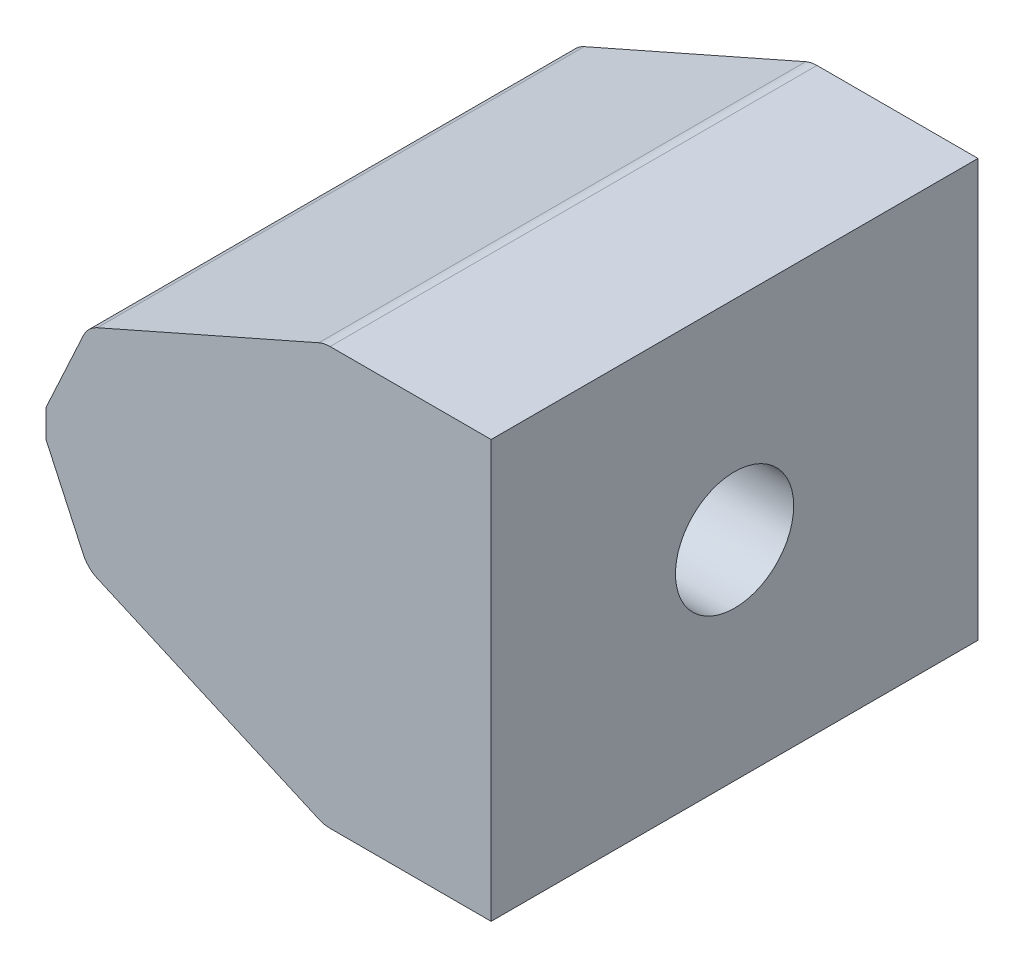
ISO-10303-21;
HEADER;
FILE_DESCRIPTION(('STEP AP214'),'2;1');
FILE_NAME('part.step','',(''),(''),'','','');
FILE_SCHEMA(('AUTOMOTIVE_DESIGN { 1 0 10303 214 1 1 1 1 }'));
ENDSEC;
DATA;
#1=APPLICATION_CONTEXT('core data for automotive mechanical design processes');
#2=APPLICATION_PROTOCOL_DEFINITION('international standard','automotive_design',2000,#1);
#3=PRODUCT_CONTEXT('',#1,'mechanical');
#4=PRODUCT('Part','Part','',(#3));
#5=PRODUCT_RELATED_PRODUCT_CATEGORY('part','',(#4));
#6=PRODUCT_DEFINITION_FORMATION('','',#4);
#7=PRODUCT_DEFINITION_CONTEXT('part definition',#1,'design');
#8=PRODUCT_DEFINITION('design','',#6,#7);
#9=PRODUCT_DEFINITION_SHAPE('','',#8);
#10=(LENGTH_UNIT() NAMED_UNIT(*) SI_UNIT(.MILLI.,.METRE.));
#11=(NAMED_UNIT(*) PLANE_ANGLE_UNIT() SI_UNIT($,.RADIAN.));
#12=(NAMED_UNIT(*) SI_UNIT($,.STERADIAN.) SOLID_ANGLE_UNIT());
#13=UNCERTAINTY_MEASURE_WITH_UNIT(LENGTH_MEASURE(1.E-05),#10,'distance_accuracy_value','');
#14=(GEOMETRIC_REPRESENTATION_CONTEXT(3) GLOBAL_UNCERTAINTY_ASSIGNED_CONTEXT((#13)) GLOBAL_UNIT_ASSIGNED_CONTEXT((#10,
#11,#12)) REPRESENTATION_CONTEXT('',''));
#15=CARTESIAN_POINT('',(0.,0.,0.));
#16=DIRECTION('',(0.,0.,1.));
#17=DIRECTION('',(1.,0.,0.));
#18=AXIS2_PLACEMENT_3D('',#15,#16,#17);
#19=CARTESIAN_POINT('',(4.49906287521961,5.9753625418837,17.5));
#20=DIRECTION('',(0.,0.,-1.));
#21=DIRECTION('',(-1.,0.,0.));
#22=AXIS2_PLACEMENT_3D('',#19,#20,#21);
#23=CYLINDRICAL_SURFACE('',#22,2.);
#24=CARTESIAN_POINT('',(4.49906287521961,5.9753625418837,-17.5));
#25=DIRECTION('',(0.,0.,1.));
#26=DIRECTION('',(-1.,0.,0.));
#27=AXIS2_PLACEMENT_3D('',#24,#25,#26);
#28=CIRCLE('',#27,2.);
#29=CARTESIAN_POINT('',(3.69178246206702,7.80519814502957,-17.5));
#30=VERTEX_POINT('',#29);
#31=CARTESIAN_POINT('',(2.68314410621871,6.8134788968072,-17.5));
#32=VERTEX_POINT('',#31);
#33=EDGE_CURVE('E132',#30,#32,#28,.T.);
#34=ORIENTED_EDGE('',*,*,#33,.T.);
#35=DIRECTION('',(0.,0.,-1.));
#36=VECTOR('',#35,1.);
#37=CARTESIAN_POINT('',(2.68314410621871,6.8134788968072,17.5));
#38=LINE('',#37,#36);
#39=CARTESIAN_POINT('',(2.68314410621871,6.8134788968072,17.5));
#40=VERTEX_POINT('',#39);
#41=EDGE_CURVE('E11',#40,#32,#38,.T.);
#42=ORIENTED_EDGE('',*,*,#41,.F.);
#43=CARTESIAN_POINT('',(4.49906287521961,5.9753625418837,17.5));
#44=DIRECTION('',(0.,0.,1.));
#45=DIRECTION('',(-1.,0.,0.));
#46=AXIS2_PLACEMENT_3D('',#43,#44,#45);
#47=CIRCLE('',#46,2.);
#48=CARTESIAN_POINT('',(3.69178246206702,7.80519814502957,17.5));
#49=VERTEX_POINT('',#48);
#50=EDGE_CURVE('E171',#49,#40,#47,.T.);
#51=ORIENTED_EDGE('',*,*,#50,.F.);
#52=DIRECTION('',(0.,0.,-1.));
#53=VECTOR('',#52,1.);
#54=CARTESIAN_POINT('',(3.69178246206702,7.80519814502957,17.5));
#55=LINE('',#54,#53);
#56=EDGE_CURVE('E145',#49,#30,#55,.T.);
#57=ORIENTED_EDGE('',*,*,#56,.T.);
#58=EDGE_LOOP('',(#34,#42,#51,#57));
#59=FACE_BOUND('',#58,.T.);
#60=ADVANCED_FACE('F39',(#59),#23,.T.);
#61=CARTESIAN_POINT('',(0.,1.,17.5));
#62=DIRECTION('',(0.907959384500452,-0.419058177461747,0.));
#63=DIRECTION('',(0.419058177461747,0.907959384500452,0.));
#64=AXIS2_PLACEMENT_3D('',#61,#62,#63);
#65=PLANE('',#64);
#66=DIRECTION('',(-0.419058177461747,-0.907959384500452,0.));
#67=VECTOR('',#66,1.);
#68=CARTESIAN_POINT('',(0.,1.,-17.5));
#69=LINE('',#68,#67);
#70=CARTESIAN_POINT('',(0.,1.,-17.5));
#71=VERTEX_POINT('',#70);
#72=EDGE_CURVE('E128',#32,#71,#69,.T.);
#73=ORIENTED_EDGE('',*,*,#72,.T.);
#74=DIRECTION('',(0.,0.,-1.));
#75=VECTOR('',#74,1.);
#76=CARTESIAN_POINT('',(0.,1.,17.5));
#77=LINE('',#76,#75);
#78=CARTESIAN_POINT('',(0.,1.,17.5));
#79=VERTEX_POINT('',#78);
#80=EDGE_CURVE('E47',#79,#71,#77,.T.);
#81=ORIENTED_EDGE('',*,*,#80,.F.);
#82=DIRECTION('',(-0.419058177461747,-0.907959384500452,0.));
#83=VECTOR('',#82,1.);
#84=CARTESIAN_POINT('',(0.,1.,17.5));
#85=LINE('',#84,#83);
#86=EDGE_CURVE('E141',#40,#79,#85,.T.);
#87=ORIENTED_EDGE('',*,*,#86,.F.);
#88=ORIENTED_EDGE('',*,*,#41,.T.);
#89=EDGE_LOOP('',(#73,#81,#87,#88));
#90=FACE_BOUND('',#89,.T.);
#91=ADVANCED_FACE('F140',(#90),#65,.F.);
#92=CARTESIAN_POINT('',(0.,-1.,17.5));
#93=DIRECTION('',(1.,0.,0.));
#94=DIRECTION('',(0.,0.,-1.));
#95=AXIS2_PLACEMENT_3D('',#92,#93,#94);
#96=PLANE('',#95);
#97=CARTESIAN_POINT('',(0.,0.,0.));
#98=DIRECTION('',(1.,0.,0.));
#99=DIRECTION('',(0.,0.,-1.));
#100=AXIS2_PLACEMENT_3D('',#97,#98,#99);
#101=CIRCLE('',#100,0.921441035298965);
#102=CARTESIAN_POINT('',(0.,0.,-0.921441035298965));
#103=VERTEX_POINT('',#102);
#104=EDGE_CURVE('E42',#103,#103,#101,.T.);
#105=ORIENTED_EDGE('',*,*,#104,.T.);
#106=EDGE_LOOP('',(#105));
#107=FACE_BOUND('',#106,.T.);
#108=DIRECTION('',(0.,-1.,0.));
#109=VECTOR('',#108,1.);
#110=CARTESIAN_POINT('',(0.,-1.,-17.5));
#111=LINE('',#110,#109);
#112=CARTESIAN_POINT('',(0.,-1.,-17.5));
#113=VERTEX_POINT('',#112);
#114=EDGE_CURVE('E134',#71,#113,#111,.T.);
#115=ORIENTED_EDGE('',*,*,#114,.T.);
#116=DIRECTION('',(0.,0.,-1.));
#117=VECTOR('',#116,1.);
#118=CARTESIAN_POINT('',(0.,-1.,17.5));
#119=LINE('',#118,#117);
#120=CARTESIAN_POINT('',(0.,-1.,17.5));
#121=VERTEX_POINT('',#120);
#122=EDGE_CURVE('E217',#121,#113,#119,.T.);
#123=ORIENTED_EDGE('',*,*,#122,.F.);
#124=DIRECTION('',(0.,-1.,0.));
#125=VECTOR('',#124,1.);
#126=CARTESIAN_POINT('',(0.,-1.,17.5));
#127=LINE('',#126,#125);
#128=EDGE_CURVE('E174',#79,#121,#127,.T.);
#129=ORIENTED_EDGE('',*,*,#128,.F.);
#130=ORIENTED_EDGE('',*,*,#80,.T.);
#131=EDGE_LOOP('',(#115,#123,#129,#130));
#132=FACE_BOUND('',#131,.T.);
#133=ADVANCED_FACE('F222',(#107,#132),#96,.F.);
#134=CARTESIAN_POINT('',(0.,-1.,17.5));
#135=DIRECTION('',(0.907959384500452,0.419058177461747,0.));
#136=DIRECTION('',(-0.419058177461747,0.907959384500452,0.));
#137=AXIS2_PLACEMENT_3D('',#134,#135,#136);
#138=PLANE('',#137);
#139=DIRECTION('',(0.419058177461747,-0.907959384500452,0.));
#140=VECTOR('',#139,1.);
#141=CARTESIAN_POINT('',(0.,-1.,-17.5));
#142=LINE('',#141,#140);
#143=CARTESIAN_POINT('',(2.68314410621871,-6.8134788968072,-17.5));
#144=VERTEX_POINT('',#143);
#145=EDGE_CURVE('E153',#113,#144,#142,.T.);
#146=ORIENTED_EDGE('',*,*,#145,.T.);
#147=DIRECTION('',(0.,0.,-1.));
#148=VECTOR('',#147,1.);
#149=CARTESIAN_POINT('',(2.68314410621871,-6.8134788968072,17.5));
#150=LINE('',#149,#148);
#151=CARTESIAN_POINT('',(2.68314410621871,-6.8134788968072,17.5));
#152=VERTEX_POINT('',#151);
#153=EDGE_CURVE('E214',#152,#144,#150,.T.);
#154=ORIENTED_EDGE('',*,*,#153,.F.);
#155=DIRECTION('',(0.419058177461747,-0.907959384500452,0.));
#156=VECTOR('',#155,1.);
#157=CARTESIAN_POINT('',(0.,-1.,17.5));
#158=LINE('',#157,#156);
#159=EDGE_CURVE('E176',#121,#152,#158,.T.);
#160=ORIENTED_EDGE('',*,*,#159,.F.);
#161=ORIENTED_EDGE('',*,*,#122,.T.);
#162=EDGE_LOOP('',(#146,#154,#160,#161));
#163=FACE_BOUND('',#162,.T.);
#164=ADVANCED_FACE('F230',(#163),#138,.F.);
#165=CARTESIAN_POINT('',(4.49906287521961,-5.9753625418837,17.5));
#166=DIRECTION('',(0.,0.,-1.));
#167=DIRECTION('',(-1.,0.,0.));
#168=AXIS2_PLACEMENT_3D('',#165,#166,#167);
#169=CYLINDRICAL_SURFACE('',#168,2.);
#170=CARTESIAN_POINT('',(4.49906287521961,-5.9753625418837,-17.5));
#171=DIRECTION('',(0.,0.,1.));
#172=DIRECTION('',(-1.,0.,0.));
#173=AXIS2_PLACEMENT_3D('',#170,#171,#172);
#174=CIRCLE('',#173,2.);
#175=CARTESIAN_POINT('',(3.69178246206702,-7.80519814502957,-17.5));
#176=VERTEX_POINT('',#175);
#177=EDGE_CURVE('E155',#144,#176,#174,.T.);
#178=ORIENTED_EDGE('',*,*,#177,.T.);
#179=DIRECTION('',(0.,0.,-1.));
#180=VECTOR('',#179,1.);
#181=CARTESIAN_POINT('',(3.69178246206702,-7.80519814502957,17.5));
#182=LINE('',#181,#180);
#183=CARTESIAN_POINT('',(3.69178246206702,-7.80519814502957,17.5));
#184=VERTEX_POINT('',#183);
#185=EDGE_CURVE('E211',#184,#176,#182,.T.);
#186=ORIENTED_EDGE('',*,*,#185,.F.);
#187=CARTESIAN_POINT('',(4.49906287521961,-5.9753625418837,17.5));
#188=DIRECTION('',(0.,0.,1.));
#189=DIRECTION('',(-1.,0.,0.));
#190=AXIS2_PLACEMENT_3D('',#187,#188,#189);
#191=CIRCLE('',#190,2.);
#192=EDGE_CURVE('E178',#152,#184,#191,.T.);
#193=ORIENTED_EDGE('',*,*,#192,.F.);
#194=ORIENTED_EDGE('',*,*,#153,.T.);
#195=EDGE_LOOP('',(#178,#186,#193,#194));
#196=FACE_BOUND('',#195,.T.);
#197=ADVANCED_FACE('F233',(#196),#169,.T.);
#198=CARTESIAN_POINT('',(3.69178246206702,-7.80519814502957,17.5));
#199=DIRECTION('',(0.403640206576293,0.914917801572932,0.));
#200=DIRECTION('',(-0.914917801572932,0.403640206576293,0.));
#201=AXIS2_PLACEMENT_3D('',#198,#199,#200);
#202=PLANE('',#201);
#203=DIRECTION('',(0.914917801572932,-0.403640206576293,0.));
#204=VECTOR('',#203,1.);
#205=CARTESIAN_POINT('',(3.69178246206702,-7.80519814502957,-17.5));
#206=LINE('',#205,#204);
#207=CARTESIAN_POINT('',(19.6142940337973,-14.8298356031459,-17.5));
#208=VERTEX_POINT('',#207);
#209=EDGE_CURVE('E157',#176,#208,#206,.T.);
#210=ORIENTED_EDGE('',*,*,#209,.T.);
#211=DIRECTION('',(0.,0.,-1.));
#212=VECTOR('',#211,1.);
#213=CARTESIAN_POINT('',(19.6142940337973,-14.8298356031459,17.5));
#214=LINE('',#213,#212);
#215=CARTESIAN_POINT('',(19.6142940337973,-14.8298356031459,17.5));
#216=VERTEX_POINT('',#215);
#217=EDGE_CURVE('E208',#216,#208,#214,.T.);
#218=ORIENTED_EDGE('',*,*,#217,.F.);
#219=DIRECTION('',(0.914917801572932,-0.403640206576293,0.));
#220=VECTOR('',#219,1.);
#221=CARTESIAN_POINT('',(3.69178246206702,-7.80519814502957,17.5));
#222=LINE('',#221,#220);
#223=EDGE_CURVE('E180',#184,#216,#222,.T.);
#224=ORIENTED_EDGE('',*,*,#223,.F.);
#225=ORIENTED_EDGE('',*,*,#185,.T.);
#226=EDGE_LOOP('',(#210,#218,#224,#225));
#227=FACE_BOUND('',#226,.T.);
#228=ADVANCED_FACE('F238',(#227),#202,.F.);
#229=CARTESIAN_POINT('',(20.4215744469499,-13.,17.5));
#230=DIRECTION('',(0.,0.,-1.));
#231=DIRECTION('',(-1.,0.,0.));
#232=AXIS2_PLACEMENT_3D('',#229,#230,#231);
#233=CYLINDRICAL_SURFACE('',#232,2.);
#234=CARTESIAN_POINT('',(20.4215744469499,-13.,-17.5));
#235=DIRECTION('',(0.,0.,1.));
#236=DIRECTION('',(-1.,0.,0.));
#237=AXIS2_PLACEMENT_3D('',#234,#235,#236);
#238=CIRCLE('',#237,2.);
#239=CARTESIAN_POINT('',(20.4215744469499,-15.,-17.5));
#240=VERTEX_POINT('',#239);
#241=EDGE_CURVE('E159',#208,#240,#238,.T.);
#242=ORIENTED_EDGE('',*,*,#241,.T.);
#243=DIRECTION('',(0.,0.,-1.));
#244=VECTOR('',#243,1.);
#245=CARTESIAN_POINT('',(20.4215744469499,-15.,17.5));
#246=LINE('',#245,#244);
#247=CARTESIAN_POINT('',(20.4215744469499,-15.,17.5));
#248=VERTEX_POINT('',#247);
#249=EDGE_CURVE('E205',#248,#240,#246,.T.);
#250=ORIENTED_EDGE('',*,*,#249,.F.);
#251=CARTESIAN_POINT('',(20.4215744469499,-13.,17.5));
#252=DIRECTION('',(0.,0.,1.));
#253=DIRECTION('',(-1.,0.,0.));
#254=AXIS2_PLACEMENT_3D('',#251,#252,#253);
#255=CIRCLE('',#254,2.);
#256=EDGE_CURVE('E182',#216,#248,#255,.T.);
#257=ORIENTED_EDGE('',*,*,#256,.F.);
#258=ORIENTED_EDGE('',*,*,#217,.T.);
#259=EDGE_LOOP('',(#242,#250,#257,#258));
#260=FACE_BOUND('',#259,.T.);
#261=ADVANCED_FACE('F244',(#260),#233,.T.);
#262=CARTESIAN_POINT('',(20.4215744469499,-15.,17.5));
#263=DIRECTION('',(0.,1.,0.));
#264=DIRECTION('',(0.,0.,1.));
#265=AXIS2_PLACEMENT_3D('',#262,#263,#264);
#266=PLANE('',#265);
#267=DIRECTION('',(1.,0.,0.));
#268=VECTOR('',#267,1.);
#269=CARTESIAN_POINT('',(20.4215744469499,-15.,-17.5));
#270=LINE('',#269,#268);
#271=CARTESIAN_POINT('',(32.,-15.,-17.5));
#272=VERTEX_POINT('',#271);
#273=EDGE_CURVE('E161',#240,#272,#270,.T.);
#274=ORIENTED_EDGE('',*,*,#273,.T.);
#275=DIRECTION('',(0.,0.,-1.));
#276=VECTOR('',#275,1.);
#277=CARTESIAN_POINT('',(32.,-15.,17.5));
#278=LINE('',#277,#276);
#279=CARTESIAN_POINT('',(32.,-15.,17.5));
#280=VERTEX_POINT('',#279);
#281=EDGE_CURVE('E202',#280,#272,#278,.T.);
#282=ORIENTED_EDGE('',*,*,#281,.F.);
#283=DIRECTION('',(1.,0.,0.));
#284=VECTOR('',#283,1.);
#285=CARTESIAN_POINT('',(20.4215744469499,-15.,17.5));
#286=LINE('',#285,#284);
#287=EDGE_CURVE('E184',#248,#280,#286,.T.);
#288=ORIENTED_EDGE('',*,*,#287,.F.);
#289=ORIENTED_EDGE('',*,*,#249,.T.);
#290=EDGE_LOOP('',(#274,#282,#288,#289));
#291=FACE_BOUND('',#290,.T.);
#292=ADVANCED_FACE('F248',(#291),#266,.F.);
#293=CARTESIAN_POINT('',(32.,15.,17.5));
#294=DIRECTION('',(-1.,0.,0.));
#295=DIRECTION('',(0.,0.,1.));
#296=AXIS2_PLACEMENT_3D('',#293,#294,#295);
#297=PLANE('',#296);
#298=CARTESIAN_POINT('',(32.,0.,0.));
#299=DIRECTION('',(1.,0.,0.));
#300=DIRECTION('',(0.,0.,-1.));
#301=AXIS2_PLACEMENT_3D('',#298,#299,#300);
#302=CIRCLE('',#301,4.25);
#303=CARTESIAN_POINT('',(32.,0.,-4.25));
#304=VERTEX_POINT('',#303);
#305=EDGE_CURVE('E148',#304,#304,#302,.T.);
#306=ORIENTED_EDGE('',*,*,#305,.F.);
#307=EDGE_LOOP('',(#306));
#308=FACE_BOUND('',#307,.T.);
#309=DIRECTION('',(0.,1.,0.));
#310=VECTOR('',#309,1.);
#311=CARTESIAN_POINT('',(32.,15.,-17.5));
#312=LINE('',#311,#310);
#313=CARTESIAN_POINT('',(32.,15.,-17.5));
#314=VERTEX_POINT('',#313);
#315=EDGE_CURVE('E163',#272,#314,#312,.T.);
#316=ORIENTED_EDGE('',*,*,#315,.T.);
#317=DIRECTION('',(0.,0.,-1.));
#318=VECTOR('',#317,1.);
#319=CARTESIAN_POINT('',(32.,15.,17.5));
#320=LINE('',#319,#318);
#321=CARTESIAN_POINT('',(32.,15.,17.5));
#322=VERTEX_POINT('',#321);
#323=EDGE_CURVE('E199',#322,#314,#320,.T.);
#324=ORIENTED_EDGE('',*,*,#323,.F.);
#325=DIRECTION('',(0.,1.,0.));
#326=VECTOR('',#325,1.);
#327=CARTESIAN_POINT('',(32.,15.,17.5));
#328=LINE('',#327,#326);
#329=EDGE_CURVE('E186',#280,#322,#328,.T.);
#330=ORIENTED_EDGE('',*,*,#329,.F.);
#331=ORIENTED_EDGE('',*,*,#281,.T.);
#332=EDGE_LOOP('',(#316,#324,#330,#331));
#333=FACE_BOUND('',#332,.T.);
#334=ADVANCED_FACE('F253',(#308,#333),#297,.F.);
#335=CARTESIAN_POINT('',(20.4215744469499,15.,17.5));
#336=DIRECTION('',(0.,-1.,0.));
#337=DIRECTION('',(0.,0.,-1.));
#338=AXIS2_PLACEMENT_3D('',#335,#336,#337);
#339=PLANE('',#338);
#340=DIRECTION('',(-1.,0.,0.));
#341=VECTOR('',#340,1.);
#342=CARTESIAN_POINT('',(20.4215744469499,15.,-17.5));
#343=LINE('',#342,#341);
#344=CARTESIAN_POINT('',(20.4215744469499,15.,-17.5));
#345=VERTEX_POINT('',#344);
#346=EDGE_CURVE('E165',#314,#345,#343,.T.);
#347=ORIENTED_EDGE('',*,*,#346,.T.);
#348=DIRECTION('',(0.,0.,-1.));
#349=VECTOR('',#348,1.);
#350=CARTESIAN_POINT('',(20.4215744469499,15.,17.5));
#351=LINE('',#350,#349);
#352=CARTESIAN_POINT('',(20.4215744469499,15.,17.5));
#353=VERTEX_POINT('',#352);
#354=EDGE_CURVE('E196',#353,#345,#351,.T.);
#355=ORIENTED_EDGE('',*,*,#354,.F.);
#356=DIRECTION('',(-1.,0.,0.));
#357=VECTOR('',#356,1.);
#358=CARTESIAN_POINT('',(20.4215744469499,15.,17.5));
#359=LINE('',#358,#357);
#360=EDGE_CURVE('E188',#322,#353,#359,.T.);
#361=ORIENTED_EDGE('',*,*,#360,.F.);
#362=ORIENTED_EDGE('',*,*,#323,.T.);
#363=EDGE_LOOP('',(#347,#355,#361,#362));
#364=FACE_BOUND('',#363,.T.);
#365=ADVANCED_FACE('F257',(#364),#339,.F.);
#366=CARTESIAN_POINT('',(20.4215744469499,13.,17.5));
#367=DIRECTION('',(0.,0.,-1.));
#368=DIRECTION('',(-1.,0.,0.));
#369=AXIS2_PLACEMENT_3D('',#366,#367,#368);
#370=CYLINDRICAL_SURFACE('',#369,2.);
#371=CARTESIAN_POINT('',(20.4215744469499,13.,-17.5));
#372=DIRECTION('',(0.,0.,1.));
#373=DIRECTION('',(-1.,0.,0.));
#374=AXIS2_PLACEMENT_3D('',#371,#372,#373);
#375=CIRCLE('',#374,2.);
#376=CARTESIAN_POINT('',(19.6142940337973,14.8298356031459,-17.5));
#377=VERTEX_POINT('',#376);
#378=EDGE_CURVE('E167',#345,#377,#375,.T.);
#379=ORIENTED_EDGE('',*,*,#378,.T.);
#380=DIRECTION('',(0.,0.,-1.));
#381=VECTOR('',#380,1.);
#382=CARTESIAN_POINT('',(19.6142940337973,14.8298356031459,17.5));
#383=LINE('',#382,#381);
#384=CARTESIAN_POINT('',(19.6142940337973,14.8298356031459,17.5));
#385=VERTEX_POINT('',#384);
#386=EDGE_CURVE('E193',#385,#377,#383,.T.);
#387=ORIENTED_EDGE('',*,*,#386,.F.);
#388=CARTESIAN_POINT('',(20.4215744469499,13.,17.5));
#389=DIRECTION('',(0.,0.,1.));
#390=DIRECTION('',(-1.,0.,0.));
#391=AXIS2_PLACEMENT_3D('',#388,#389,#390);
#392=CIRCLE('',#391,2.);
#393=EDGE_CURVE('E59',#353,#385,#392,.T.);
#394=ORIENTED_EDGE('',*,*,#393,.F.);
#395=ORIENTED_EDGE('',*,*,#354,.T.);
#396=EDGE_LOOP('',(#379,#387,#394,#395));
#397=FACE_BOUND('',#396,.T.);
#398=ADVANCED_FACE('F261',(#397),#370,.T.);
#399=CARTESIAN_POINT('',(3.69178246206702,7.80519814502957,17.5));
#400=DIRECTION('',(0.403640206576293,-0.914917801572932,0.));
#401=DIRECTION('',(0.914917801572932,0.403640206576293,0.));
#402=AXIS2_PLACEMENT_3D('',#399,#400,#401);
#403=PLANE('',#402);
#404=DIRECTION('',(-0.914917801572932,-0.403640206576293,0.));
#405=VECTOR('',#404,1.);
#406=CARTESIAN_POINT('',(3.69178246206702,7.80519814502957,-17.5));
#407=LINE('',#406,#405);
#408=EDGE_CURVE('E169',#377,#30,#407,.T.);
#409=ORIENTED_EDGE('',*,*,#408,.T.);
#410=ORIENTED_EDGE('',*,*,#56,.F.);
#411=DIRECTION('',(-0.914917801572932,-0.403640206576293,0.));
#412=VECTOR('',#411,1.);
#413=CARTESIAN_POINT('',(3.69178246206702,7.80519814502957,17.5));
#414=LINE('',#413,#412);
#415=EDGE_CURVE('E54',#385,#49,#414,.T.);
#416=ORIENTED_EDGE('',*,*,#415,.F.);
#417=ORIENTED_EDGE('',*,*,#386,.T.);
#418=EDGE_LOOP('',(#409,#410,#416,#417));
#419=FACE_BOUND('',#418,.T.);
#420=ADVANCED_FACE('F263',(#419),#403,.F.);
#421=CARTESIAN_POINT('',(4.49906287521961,5.9753625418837,17.5));
#422=DIRECTION('',(0.,0.,-1.));
#423=DIRECTION('',(-1.,0.,0.));
#424=AXIS2_PLACEMENT_3D('',#421,#422,#423);
#425=PLANE('',#424);
#426=ORIENTED_EDGE('',*,*,#50,.T.);
#427=ORIENTED_EDGE('',*,*,#86,.T.);
#428=ORIENTED_EDGE('',*,*,#128,.T.);
#429=ORIENTED_EDGE('',*,*,#159,.T.);
#430=ORIENTED_EDGE('',*,*,#192,.T.);
#431=ORIENTED_EDGE('',*,*,#223,.T.);
#432=ORIENTED_EDGE('',*,*,#256,.T.);
#433=ORIENTED_EDGE('',*,*,#287,.T.);
#434=ORIENTED_EDGE('',*,*,#329,.T.);
#435=ORIENTED_EDGE('',*,*,#360,.T.);
#436=ORIENTED_EDGE('',*,*,#393,.T.);
#437=ORIENTED_EDGE('',*,*,#415,.T.);
#438=EDGE_LOOP('',(#426,#427,#428,#429,#430,#431,#432,#433,#434,#435,#436,#437));
#439=FACE_BOUND('',#438,.T.);
#440=ADVANCED_FACE('F225',(#439),#425,.F.);
#441=CARTESIAN_POINT('',(4.49906287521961,5.9753625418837,-17.5));
#442=DIRECTION('',(0.,0.,-1.));
#443=DIRECTION('',(-1.,0.,0.));
#444=AXIS2_PLACEMENT_3D('',#441,#442,#443);
#445=PLANE('',#444);
#446=ORIENTED_EDGE('',*,*,#33,.F.);
#447=ORIENTED_EDGE('',*,*,#408,.F.);
#448=ORIENTED_EDGE('',*,*,#378,.F.);
#449=ORIENTED_EDGE('',*,*,#346,.F.);
#450=ORIENTED_EDGE('',*,*,#315,.F.);
#451=ORIENTED_EDGE('',*,*,#273,.F.);
#452=ORIENTED_EDGE('',*,*,#241,.F.);
#453=ORIENTED_EDGE('',*,*,#209,.F.);
#454=ORIENTED_EDGE('',*,*,#177,.F.);
#455=ORIENTED_EDGE('',*,*,#145,.F.);
#456=ORIENTED_EDGE('',*,*,#114,.F.);
#457=ORIENTED_EDGE('',*,*,#72,.F.);
#458=EDGE_LOOP('',(#446,#447,#448,#449,#450,#451,#452,#453,#454,#455,#456,#457));
#459=FACE_BOUND('',#458,.T.);
#460=ADVANCED_FACE('F129',(#459),#445,.T.);
#461=CARTESIAN_POINT('',(2.,0.,0.));
#462=DIRECTION('',(1.,0.,0.));
#463=DIRECTION('',(0.,0.,-1.));
#464=AXIS2_PLACEMENT_3D('',#461,#462,#463);
#465=CONICAL_SURFACE('',#464,4.24999999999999,1.02974425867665);
#466=CARTESIAN_POINT('',(2.,0.,0.));
#467=DIRECTION('',(1.,0.,0.));
#468=DIRECTION('',(0.,0.,-1.));
#469=AXIS2_PLACEMENT_3D('',#466,#467,#468);
#470=CIRCLE('',#469,4.24999999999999);
#471=CARTESIAN_POINT('',(2.,0.,-4.24999999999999));
#472=VERTEX_POINT('',#471);
#473=EDGE_CURVE('E369',#472,#472,#470,.T.);
#474=CARTESIAN_POINT('',(2.,0.,-4.24999999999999));
#475=CARTESIAN_POINT('',(1.97916666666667,0.,-4.21532751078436));
#476=CARTESIAN_POINT('',(1.95833333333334,0.,-4.18065502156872));
#477=CARTESIAN_POINT('',(1.91666666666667,0.,-4.11131004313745));
#478=CARTESIAN_POINT('',(1.89583333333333,0.,-4.07663755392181));
#479=CARTESIAN_POINT('',(1.85416666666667,0.,-4.00729257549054));
#480=CARTESIAN_POINT('',(1.83333333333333,0.,-3.97262008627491));
#481=CARTESIAN_POINT('',(1.79166666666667,0.,-3.90327510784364));
#482=CARTESIAN_POINT('',(1.77083333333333,0.,-3.868602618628));
#483=CARTESIAN_POINT('',(1.72916666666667,0.,-3.79925764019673));
#484=CARTESIAN_POINT('',(1.70833333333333,0.,-3.76458515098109));
#485=CARTESIAN_POINT('',(1.66666666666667,0.,-3.69524017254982));
#486=CARTESIAN_POINT('',(1.64583333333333,0.,-3.66056768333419));
#487=CARTESIAN_POINT('',(1.60416666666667,0.,-3.59122270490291));
#488=CARTESIAN_POINT('',(1.58333333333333,0.,-3.55655021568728));
#489=CARTESIAN_POINT('',(1.54166666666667,0.,-3.48720523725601));
#490=CARTESIAN_POINT('',(1.52083333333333,0.,-3.45253274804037));
#491=CARTESIAN_POINT('',(1.47916666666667,0.,-3.3831877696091));
#492=CARTESIAN_POINT('',(1.45833333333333,0.,-3.34851528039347));
#493=CARTESIAN_POINT('',(1.41666666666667,0.,-3.27917030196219));
#494=CARTESIAN_POINT('',(1.39583333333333,0.,-3.24449781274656));
#495=CARTESIAN_POINT('',(1.35416666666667,0.,-3.17515283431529));
#496=CARTESIAN_POINT('',(1.33333333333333,0.,-3.14048034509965));
#497=CARTESIAN_POINT('',(1.29166666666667,0.,-3.07113536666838));
#498=CARTESIAN_POINT('',(1.27083333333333,0.,-3.03646287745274));
#499=CARTESIAN_POINT('',(1.22916666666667,0.,-2.96711789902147));
#500=CARTESIAN_POINT('',(1.20833333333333,0.,-2.93244540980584));
#501=CARTESIAN_POINT('',(1.16666666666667,0.,-2.86310043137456));
#502=CARTESIAN_POINT('',(1.14583333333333,0.,-2.82842794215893));
#503=CARTESIAN_POINT('',(1.10416666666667,0.,-2.75908296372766));
#504=CARTESIAN_POINT('',(1.08333333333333,0.,-2.72441047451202));
#505=CARTESIAN_POINT('',(1.04166666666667,0.,-2.65506549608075));
#506=CARTESIAN_POINT('',(1.02083333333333,0.,-2.62039300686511));
#507=CARTESIAN_POINT('',(0.979166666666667,0.,-2.55104802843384));
#508=CARTESIAN_POINT('',(0.958333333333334,0.,-2.51637553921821));
#509=CARTESIAN_POINT('',(0.916666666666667,0.,-2.44703056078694));
#510=CARTESIAN_POINT('',(0.895833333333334,0.,-2.4123580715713));
#511=CARTESIAN_POINT('',(0.854166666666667,0.,-2.34301309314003));
#512=CARTESIAN_POINT('',(0.833333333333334,0.,-2.30834060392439));
#513=CARTESIAN_POINT('',(0.791666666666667,0.,-2.23899562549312));
#514=CARTESIAN_POINT('',(0.770833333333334,0.,-2.20432313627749));
#515=CARTESIAN_POINT('',(0.729166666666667,0.,-2.13497815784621));
#516=CARTESIAN_POINT('',(0.708333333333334,0.,-2.10030566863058));
#517=CARTESIAN_POINT('',(0.666666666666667,0.,-2.03096069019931));
#518=CARTESIAN_POINT('',(0.645833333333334,0.,-1.99628820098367));
#519=CARTESIAN_POINT('',(0.604166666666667,0.,-1.9269432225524));
#520=CARTESIAN_POINT('',(0.583333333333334,0.,-1.89227073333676));
#521=CARTESIAN_POINT('',(0.541666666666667,0.,-1.82292575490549));
#522=CARTESIAN_POINT('',(0.520833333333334,0.,-1.78825326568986));
#523=CARTESIAN_POINT('',(0.479166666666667,0.,-1.71890828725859));
#524=CARTESIAN_POINT('',(0.458333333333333,0.,-1.68423579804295));
#525=CARTESIAN_POINT('',(0.416666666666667,0.,-1.61489081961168));
#526=CARTESIAN_POINT('',(0.395833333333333,0.,-1.58021833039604));
#527=CARTESIAN_POINT('',(0.354166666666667,0.,-1.51087335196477));
#528=CARTESIAN_POINT('',(0.333333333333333,0.,-1.47620086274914));
#529=CARTESIAN_POINT('',(0.291666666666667,0.,-1.40685588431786));
#530=CARTESIAN_POINT('',(0.270833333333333,0.,-1.37218339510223));
#531=CARTESIAN_POINT('',(0.229166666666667,0.,-1.30283841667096));
#532=CARTESIAN_POINT('',(0.208333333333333,0.,-1.26816592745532));
#533=CARTESIAN_POINT('',(0.166666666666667,0.,-1.19882094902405));
#534=CARTESIAN_POINT('',(0.145833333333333,0.,-1.16414845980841));
#535=CARTESIAN_POINT('',(0.104166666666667,0.,-1.09480348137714));
#536=CARTESIAN_POINT('',(0.0833333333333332,0.,-1.06013099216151));
#537=CARTESIAN_POINT('',(0.0416666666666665,0.,-0.990786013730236));
#538=CARTESIAN_POINT('',(0.0208333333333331,0.,-0.9561135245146));
#539=CARTESIAN_POINT('',(0.,0.,-0.921441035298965));
#540=B_SPLINE_CURVE_WITH_KNOTS('',3,(#474,#475,#476,#477,#478,#479,#480,#481,#482,#483,#484,
#485,#486,#487,#488,#489,#490,#491,#492,#493,#494,#495,#496,#497,#498,#499,#500,#501,#502,#503,
#504,#505,#506,#507,#508,#509,#510,#511,#512,#513,#514,#515,#516,#517,#518,#519,#520,#521,#522,
#523,#524,#525,#526,#527,#528,#529,#530,#531,#532,#533,#534,#535,#536,#537,#538,#539),
.UNSPECIFIED.,.F.,.F.,(4,2,2,2,2,2,2,2,2,2,2,2,2,2,2,2,2,2,2,2,2,2,2,2,2,2,2,2,2,2,2,2,4),(0.,
0.121350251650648,0.242700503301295,0.364050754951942,0.485401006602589,0.606751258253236,
0.728101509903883,0.84945176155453,0.970802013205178,1.09215226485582,1.21350251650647,
1.33485276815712,1.45620301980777,1.57755327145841,1.69890352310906,1.82025377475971,
1.94160402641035,2.062954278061,2.18430452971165,2.3056547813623,2.42700503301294,
2.54835528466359,2.66970553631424,2.79105578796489,2.91240603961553,3.03375629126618,
3.15510654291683,3.27645679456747,3.39780704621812,3.51915729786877,3.64050754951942,
3.76185780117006,3.88320805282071),.UNSPECIFIED.);
#541=EDGE_CURVE('BSEAM328',#472,#103,#540,.T.);
#542=ORIENTED_EDGE('',*,*,#473,.T.);
#543=ORIENTED_EDGE('',*,*,#104,.F.);
#544=ORIENTED_EDGE('',*,*,#541,.T.);
#545=ORIENTED_EDGE('',*,*,#541,.F.);
#546=EDGE_LOOP('',(#542,#544,#543,#545));
#547=FACE_BOUND('',#546,.T.);
#548=ADVANCED_FACE('F328',(#547),#465,.F.);
#549=CARTESIAN_POINT('',(32.,0.,0.));
#550=DIRECTION('',(1.,0.,0.));
#551=DIRECTION('',(0.,0.,-1.));
#552=AXIS2_PLACEMENT_3D('',#549,#550,#551);
#553=CYLINDRICAL_SURFACE('',#552,4.25);
#554=ORIENTED_EDGE('',*,*,#473,.F.);
#555=EDGE_LOOP('',(#554));
#556=FACE_BOUND('',#555,.T.);
#557=ORIENTED_EDGE('',*,*,#305,.T.);
#558=EDGE_LOOP('',(#557));
#559=FACE_BOUND('',#558,.T.);
#560=ADVANCED_FACE('F350',(#556,#559),#553,.F.);
#561=CLOSED_SHELL('',(#60,#91,#133,#164,#197,#228,#261,#292,#334,#365,#398,#420,#440,#460,#548,#560));
#562=MANIFOLD_SOLID_BREP('B2',#561);
#563=ADVANCED_BREP_SHAPE_REPRESENTATION('',(#18,#562),#14);
#564=SHAPE_DEFINITION_REPRESENTATION(#9,#563);
ENDSEC;
END-ISO-10303-21;
